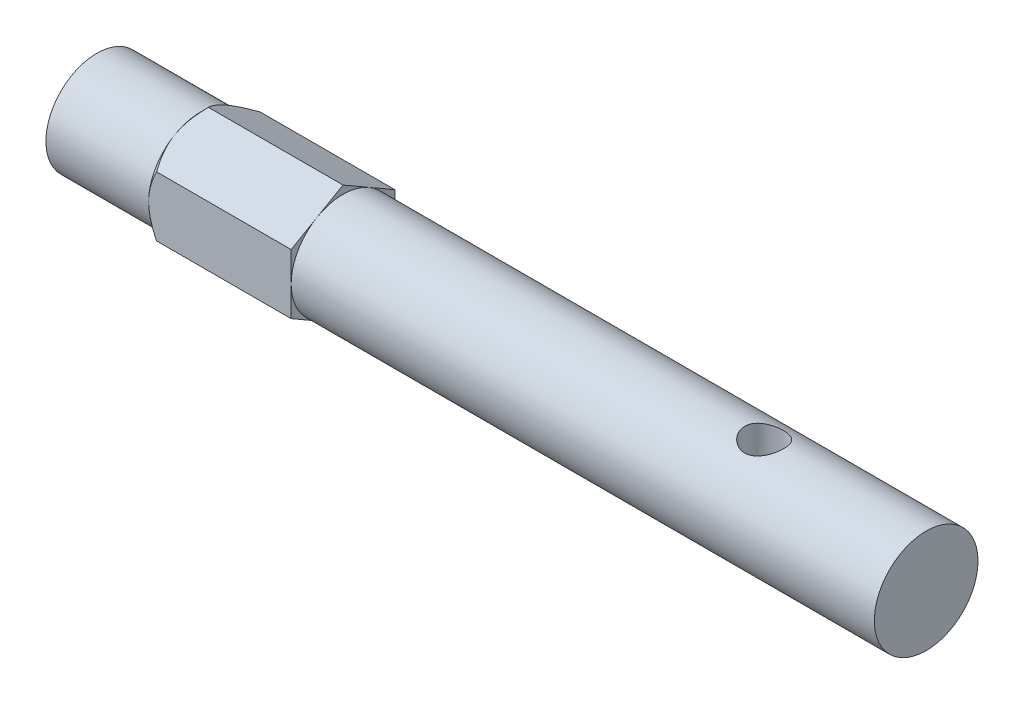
ISO-10303-21;
HEADER;
FILE_DESCRIPTION(('STEP AP214'),'2;1');
FILE_NAME('part.step','',(''),(''),'','','');
FILE_SCHEMA(('AUTOMOTIVE_DESIGN { 1 0 10303 214 1 1 1 1 }'));
ENDSEC;
DATA;
#1=APPLICATION_CONTEXT('core data for automotive mechanical design processes');
#2=APPLICATION_PROTOCOL_DEFINITION('international standard','automotive_design',2000,#1);
#3=PRODUCT_CONTEXT('',#1,'mechanical');
#4=PRODUCT('Part','Part','',(#3));
#5=PRODUCT_RELATED_PRODUCT_CATEGORY('part','',(#4));
#6=PRODUCT_DEFINITION_FORMATION('','',#4);
#7=PRODUCT_DEFINITION_CONTEXT('part definition',#1,'design');
#8=PRODUCT_DEFINITION('design','',#6,#7);
#9=PRODUCT_DEFINITION_SHAPE('','',#8);
#10=(LENGTH_UNIT() NAMED_UNIT(*) SI_UNIT(.MILLI.,.METRE.));
#11=(NAMED_UNIT(*) PLANE_ANGLE_UNIT() SI_UNIT($,.RADIAN.));
#12=(NAMED_UNIT(*) SI_UNIT($,.STERADIAN.) SOLID_ANGLE_UNIT());
#13=UNCERTAINTY_MEASURE_WITH_UNIT(LENGTH_MEASURE(1.E-05),#10,'distance_accuracy_value','');
#14=(GEOMETRIC_REPRESENTATION_CONTEXT(3) GLOBAL_UNCERTAINTY_ASSIGNED_CONTEXT((#13)) GLOBAL_UNIT_ASSIGNED_CONTEXT((#10,
#11,#12)) REPRESENTATION_CONTEXT('',''));
#15=CARTESIAN_POINT('',(0.,0.,0.));
#16=DIRECTION('',(0.,0.,1.));
#17=DIRECTION('',(1.,0.,0.));
#18=AXIS2_PLACEMENT_3D('',#15,#16,#17);
#19=CARTESIAN_POINT('',(1.,0.,0.));
#20=DIRECTION('',(1.,0.,0.));
#21=DIRECTION('',(0.,0.,-1.));
#22=AXIS2_PLACEMENT_3D('',#19,#20,#21);
#23=CONICAL_SURFACE('',#22,5.,0.78539816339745);
#24=CARTESIAN_POINT('',(0.618917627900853,4.61891762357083,0.000199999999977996));
#25=CARTESIAN_POINT('',(0.579211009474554,4.57920690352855,-0.0685809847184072));
#26=CARTESIAN_POINT('',(0.540722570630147,4.5391923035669,-0.137888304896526));
#27=CARTESIAN_POINT('',(0.466553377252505,4.45849274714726,-0.277664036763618));
#28=CARTESIAN_POINT('',(0.43087415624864,4.41780743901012,-0.348133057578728));
#29=CARTESIAN_POINT('',(0.328303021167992,4.29427352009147,-0.562100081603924));
#30=CARTESIAN_POINT('',(0.266315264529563,4.21037499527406,-0.707416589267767));
#31=CARTESIAN_POINT('',(0.160158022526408,4.04121970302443,-1.00040214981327));
#32=CARTESIAN_POINT('',(0.115721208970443,3.95600566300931,-1.14799719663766));
#33=CARTESIAN_POINT('',(0.0472511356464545,3.78369592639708,-1.44644641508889));
#34=CARTESIAN_POINT('',(0.0231667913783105,3.69660550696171,-1.59729144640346));
#35=CARTESIAN_POINT('',(0.0014370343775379,3.54650860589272,-1.85726690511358));
#36=CARTESIAN_POINT('',(-0.00177893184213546,3.48369550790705,-1.96606238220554));
#37=CARTESIAN_POINT('',(0.00364221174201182,3.35817126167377,-2.18347675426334));
#38=CARTESIAN_POINT('',(0.0122834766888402,3.29546015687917,-2.29209557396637));
#39=CARTESIAN_POINT('',(0.0409261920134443,3.1706321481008,-2.50830402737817));
#40=CARTESIAN_POINT('',(0.0609403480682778,3.10851598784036,-2.61589237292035));
#41=CARTESIAN_POINT('',(0.111236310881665,2.98535047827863,-2.82922129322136));
#42=CARTESIAN_POINT('',(0.141517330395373,2.92430104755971,-2.93496200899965));
#43=CARTESIAN_POINT('',(0.203817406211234,2.81592361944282,-3.12267722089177));
#44=CARTESIAN_POINT('',(0.234198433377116,2.76835567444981,-3.20506731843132));
#45=CARTESIAN_POINT('',(0.299856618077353,2.67407371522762,-3.36836846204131));
#46=CARTESIAN_POINT('',(0.335133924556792,2.62735972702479,-3.44927946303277));
#47=CARTESIAN_POINT('',(0.409793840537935,2.53493285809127,-3.60936749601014));
#48=CARTESIAN_POINT('',(0.44916354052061,2.48921734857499,-3.68854908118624));
#49=CARTESIAN_POINT('',(0.531491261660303,2.39863292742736,-3.84544590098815));
#50=CARTESIAN_POINT('',(0.574447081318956,2.35376351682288,-3.92316199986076));
#51=CARTESIAN_POINT('',(0.618917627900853,2.30928560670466,-4.0002));
#52=B_SPLINE_CURVE_WITH_KNOTS('',3,(#24,#25,#26,#27,#28,#29,#30,#31,#32,#33,#34,#35,#36,#37,#38,
#39,#40,#41,#42,#43,#44,#45,#46,#47,#48,#49,#50,#51),.UNSPECIFIED.,.F.,.F.,(4,2,2,2,2,2,2,2,2,2,
2,2,2,4),(0.,0.266361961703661,0.532868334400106,1.06875865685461,1.59613884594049,
2.12219135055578,2.49866160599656,2.87526382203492,3.25228760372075,3.62928248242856,
3.92874944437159,4.22822551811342,4.5267840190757,4.82516056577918),.UNSPECIFIED.);
#53=CARTESIAN_POINT('',(0.,3.46410161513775,-2.));
#54=VERTEX_POINT('',#53);
#55=CARTESIAN_POINT('',(0.618802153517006,2.3094010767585,-4.));
#56=VERTEX_POINT('',#55);
#57=EDGE_CURVE('E198',#54,#56,#52,.T.);
#58=ORIENTED_EDGE('',*,*,#57,.T.);
#59=CARTESIAN_POINT('',(2.90416980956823,-5.62739378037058,-4.));
#60=CARTESIAN_POINT('',(2.7886867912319,-5.4856730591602,-4.));
#61=CARTESIAN_POINT('',(2.67404423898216,-5.34325635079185,-4.));
#62=CARTESIAN_POINT('',(2.44688221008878,-5.05668167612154,-4.));
#63=CARTESIAN_POINT('',(2.33436328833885,-4.91252327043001,-4.));
#64=CARTESIAN_POINT('',(2.11073714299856,-4.62060451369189,-4.));
#65=CARTESIAN_POINT('',(1.99965872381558,-4.47282202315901,-4.));
#66=CARTESIAN_POINT('',(1.78088367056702,-4.17478915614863,-4.));
#67=CARTESIAN_POINT('',(1.67318671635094,-4.02453901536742,-4.));
#68=CARTESIAN_POINT('',(1.45262266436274,-3.70745510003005,-4.));
#69=CARTESIAN_POINT('',(1.34015614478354,-3.5403410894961,-4.));
#70=CARTESIAN_POINT('',(1.1219167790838,-3.2016890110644,-4.));
#71=CARTESIAN_POINT('',(1.01614603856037,-3.03014957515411,-4.));
#72=CARTESIAN_POINT('',(0.814154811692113,-2.68253937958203,-4.00000000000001));
#73=CARTESIAN_POINT('',(0.717892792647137,-2.50649297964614,-4.00000000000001));
#74=CARTESIAN_POINT('',(0.537730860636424,-2.14824323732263,-3.99999999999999));
#75=CARTESIAN_POINT('',(0.453820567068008,-1.9660452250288,-3.99999999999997));
#76=CARTESIAN_POINT('',(0.323778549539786,-1.64622345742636,-3.99999999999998));
#77=CARTESIAN_POINT('',(0.273622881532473,-1.51024779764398,-4.));
#78=CARTESIAN_POINT('',(0.184192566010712,-1.23468247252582,-4.00000000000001));
#79=CARTESIAN_POINT('',(0.144919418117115,-1.09509231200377,-4.));
#80=CARTESIAN_POINT('',(0.0801558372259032,-0.815895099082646,-4.));
#81=CARTESIAN_POINT('',(0.0543844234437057,-0.676354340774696,-4.00000000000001));
#82=CARTESIAN_POINT('',(0.0170833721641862,-0.395369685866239,-4.));
#83=CARTESIAN_POINT('',(0.00555051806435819,-0.253926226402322,-4.));
#84=CARTESIAN_POINT('',(-0.00220491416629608,0.0224344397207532,-4.));
#85=CARTESIAN_POINT('',(0.000849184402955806,0.157331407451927,-4.));
#86=CARTESIAN_POINT('',(0.0203999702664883,0.426139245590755,-4.00000000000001));
#87=CARTESIAN_POINT('',(0.036897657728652,0.560050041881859,-4.));
#88=CARTESIAN_POINT('',(0.0826693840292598,0.828249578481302,-4.));
#89=CARTESIAN_POINT('',(0.112180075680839,0.962497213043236,-4.00000000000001));
#90=CARTESIAN_POINT('',(0.18229509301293,1.22800919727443,-4.));
#91=CARTESIAN_POINT('',(0.222899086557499,1.35927363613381,-4.));
#92=CARTESIAN_POINT('',(0.314947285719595,1.62314822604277,-4.));
#93=CARTESIAN_POINT('',(0.366725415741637,1.7556404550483,-4.));
#94=CARTESIAN_POINT('',(0.478297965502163,2.0172150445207,-4.00000000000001));
#95=CARTESIAN_POINT('',(0.538094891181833,2.14629632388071,-4.));
#96=CARTESIAN_POINT('',(0.664297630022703,2.40167335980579,-4.));
#97=CARTESIAN_POINT('',(0.730723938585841,2.52795890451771,-4.));
#98=CARTESIAN_POINT('',(0.868724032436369,2.77764203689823,-4.));
#99=CARTESIAN_POINT('',(0.940297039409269,2.9010400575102,-4.));
#100=CARTESIAN_POINT('',(1.08394545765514,3.13927957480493,-4.));
#101=CARTESIAN_POINT('',(1.15582080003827,3.25424234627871,-4.));
#102=CARTESIAN_POINT('',(1.3026473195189,3.48219257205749,-4.));
#103=CARTESIAN_POINT('',(1.37759872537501,3.59517987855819,-4.));
#104=CARTESIAN_POINT('',(1.52942464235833,3.81853437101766,-4.));
#105=CARTESIAN_POINT('',(1.60627906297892,3.92891526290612,-4.));
#106=CARTESIAN_POINT('',(1.76206082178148,4.14816043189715,-4.));
#107=CARTESIAN_POINT('',(1.8409875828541,4.25702511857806,-4.));
#108=CARTESIAN_POINT('',(1.9207631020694,4.36525322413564,-4.));
#109=B_SPLINE_CURVE_WITH_KNOTS('',3,(#59,#60,#61,#62,#63,#64,#65,#66,#67,#68,#69,#70,#71,#72,
#73,#74,#75,#76,#77,#78,#79,#80,#81,#82,#83,#84,#85,#86,#87,#88,#89,#90,#91,#92,#93,#94,#95,#96,
#97,#98,#99,#100,#101,#102,#103,#104,#105,#106,#107,#108),.UNSPECIFIED.,.F.,.F.,(4,2,2,2,2,2,2,
2,2,2,2,2,2,2,2,2,2,2,2,2,2,2,2,2,4),(0.,0.548452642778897,1.0970466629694,1.65162724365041,
2.20615515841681,2.8103379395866,3.41470978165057,4.01631281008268,4.61740731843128,
5.05183569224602,5.48632390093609,5.91136971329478,6.33631948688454,6.74042244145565,
7.14455546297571,7.55636228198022,7.96815677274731,8.39458384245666,8.82114448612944,
9.24906733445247,9.67692560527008,10.0836145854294,10.4903338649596,10.8938112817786,
11.2971775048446),.UNSPECIFIED.);
#110=CARTESIAN_POINT('',(0.,0.,-4.));
#111=VERTEX_POINT('',#110);
#112=EDGE_CURVE('E11',#56,#111,#109,.F.);
#113=ORIENTED_EDGE('',*,*,#112,.T.);
#114=CARTESIAN_POINT('',(0.,0.,0.));
#115=DIRECTION('',(-1.,0.,0.));
#116=DIRECTION('',(0.,0.,1.));
#117=AXIS2_PLACEMENT_3D('',#114,#115,#116);
#118=CIRCLE('',#117,4.);
#119=EDGE_CURVE('E157',#54,#111,#118,.T.);
#120=ORIENTED_EDGE('',*,*,#119,.F.);
#121=EDGE_LOOP('',(#58,#113,#120));
#122=FACE_BOUND('',#121,.T.);
#123=ADVANCED_FACE('F32',(#122),#23,.T.);
#124=CARTESIAN_POINT('',(0.,-3.46410161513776,-2.));
#125=VERTEX_POINT('',#124);
#126=EDGE_CURVE('E561',#111,#125,#118,.T.);
#127=ORIENTED_EDGE('',*,*,#126,.F.);
#128=CARTESIAN_POINT('',(0.618802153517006,-2.3094010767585,-4.));
#129=VERTEX_POINT('',#128);
#130=EDGE_CURVE('E44',#111,#129,#109,.F.);
#131=ORIENTED_EDGE('',*,*,#130,.T.);
#132=CARTESIAN_POINT('',(0.618917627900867,-2.30928560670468,-4.0002));
#133=CARTESIAN_POINT('',(0.579211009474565,-2.34899632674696,-3.93141901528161));
#134=CARTESIAN_POINT('',(0.540722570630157,-2.38901092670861,-3.86211169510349));
#135=CARTESIAN_POINT('',(0.466553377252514,-2.46971048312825,-3.7223359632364));
#136=CARTESIAN_POINT('',(0.43087415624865,-2.51039579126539,-3.65186694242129));
#137=CARTESIAN_POINT('',(0.328303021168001,-2.63392971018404,-3.43789991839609));
#138=CARTESIAN_POINT('',(0.266315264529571,-2.71782823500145,-3.29258341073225));
#139=CARTESIAN_POINT('',(0.160158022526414,-2.88698352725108,-2.99959785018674));
#140=CARTESIAN_POINT('',(0.115721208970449,-2.9721975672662,-2.85200280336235));
#141=CARTESIAN_POINT('',(0.0472511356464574,-3.14450730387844,-2.55355358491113));
#142=CARTESIAN_POINT('',(0.02316679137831,-3.23159772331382,-2.40270855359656));
#143=CARTESIAN_POINT('',(0.00143703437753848,-3.3816946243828,-2.14273309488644));
#144=CARTESIAN_POINT('',(-0.00177893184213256,-3.44450772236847,-2.03393761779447));
#145=CARTESIAN_POINT('',(0.00364221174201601,-3.57003196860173,-1.81652324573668));
#146=CARTESIAN_POINT('',(0.0122834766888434,-3.63274307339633,-1.70790442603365));
#147=CARTESIAN_POINT('',(0.0409261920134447,-3.75757108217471,-1.49169597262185));
#148=CARTESIAN_POINT('',(0.0609403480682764,-3.81968724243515,-1.38410762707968));
#149=CARTESIAN_POINT('',(0.111236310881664,-3.94285275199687,-1.17077870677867));
#150=CARTESIAN_POINT('',(0.141517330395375,-4.00390218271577,-1.06503799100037));
#151=CARTESIAN_POINT('',(0.203817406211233,-4.11227961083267,-0.877322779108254));
#152=CARTESIAN_POINT('',(0.234198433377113,-4.15984755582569,-0.794932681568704));
#153=CARTESIAN_POINT('',(0.299856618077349,-4.25412951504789,-0.631631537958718));
#154=CARTESIAN_POINT('',(0.335133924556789,-4.30084350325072,-0.55072053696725));
#155=CARTESIAN_POINT('',(0.409793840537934,-4.39327037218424,-0.390632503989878));
#156=CARTESIAN_POINT('',(0.449163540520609,-4.43898588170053,-0.311450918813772));
#157=CARTESIAN_POINT('',(0.531491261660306,-4.52957030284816,-0.154554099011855));
#158=CARTESIAN_POINT('',(0.574447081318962,-4.57443971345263,-0.0768380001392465));
#159=CARTESIAN_POINT('',(0.618917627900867,-4.61891762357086,0.000199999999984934));
#160=B_SPLINE_CURVE_WITH_KNOTS('',3,(#132,#133,#134,#135,#136,#137,#138,#139,#140,#141,#142,
#143,#144,#145,#146,#147,#148,#149,#150,#151,#152,#153,#154,#155,#156,#157,#158,#159),
.UNSPECIFIED.,.F.,.F.,(4,2,2,2,2,2,2,2,2,2,2,2,2,4),(0.,0.266361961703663,0.532868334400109,
1.06875865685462,1.5961388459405,2.12219135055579,2.49866160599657,2.87526382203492,
3.25228760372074,3.62928248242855,3.92874944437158,4.22822551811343,4.52678401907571,
4.8251605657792),.UNSPECIFIED.);
#161=EDGE_CURVE('E355',#129,#125,#160,.T.);
#162=ORIENTED_EDGE('',*,*,#161,.T.);
#163=EDGE_LOOP('',(#127,#131,#162));
#164=FACE_BOUND('',#163,.T.);
#165=ADVANCED_FACE('F239',(#164),#23,.T.);
#166=CARTESIAN_POINT('',(0.,-3.46410161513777,2.));
#167=VERTEX_POINT('',#166);
#168=EDGE_CURVE('E151',#125,#167,#118,.T.);
#169=ORIENTED_EDGE('',*,*,#168,.F.);
#170=CARTESIAN_POINT('',(0.618802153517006,-4.618802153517,0.));
#171=VERTEX_POINT('',#170);
#172=EDGE_CURVE('E196',#125,#171,#160,.T.);
#173=ORIENTED_EDGE('',*,*,#172,.T.);
#174=CARTESIAN_POINT('',(0.618917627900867,-4.61891762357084,-0.000199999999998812));
#175=CARTESIAN_POINT('',(0.579211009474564,-4.57920690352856,0.0685809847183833));
#176=CARTESIAN_POINT('',(0.540722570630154,-4.53919230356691,0.137888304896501));
#177=CARTESIAN_POINT('',(0.46655337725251,-4.45849274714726,0.277664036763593));
#178=CARTESIAN_POINT('',(0.430874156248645,-4.41780743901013,0.348133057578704));
#179=CARTESIAN_POINT('',(0.328303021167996,-4.29427352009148,0.562100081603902));
#180=CARTESIAN_POINT('',(0.266315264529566,-4.21037499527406,0.707416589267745));
#181=CARTESIAN_POINT('',(0.160158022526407,-4.04121970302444,1.00040214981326));
#182=CARTESIAN_POINT('',(0.115721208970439,-3.95600566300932,1.14799719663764));
#183=CARTESIAN_POINT('',(0.0472511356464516,-3.78369592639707,1.44644641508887));
#184=CARTESIAN_POINT('',(0.0231667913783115,-3.69660550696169,1.59729144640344));
#185=CARTESIAN_POINT('',(0.00143703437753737,-3.5465086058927,1.85726690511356));
#186=CARTESIAN_POINT('',(-0.0017789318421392,-3.48369550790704,1.96606238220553));
#187=CARTESIAN_POINT('',(0.00364221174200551,-3.35817126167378,2.18347675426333));
#188=CARTESIAN_POINT('',(0.0122834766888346,-3.29546015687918,2.29209557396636));
#189=CARTESIAN_POINT('',(0.0409261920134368,-3.1706321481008,2.50830402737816));
#190=CARTESIAN_POINT('',(0.0609403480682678,-3.10851598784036,2.61589237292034));
#191=CARTESIAN_POINT('',(0.111236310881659,-2.98535047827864,2.82922129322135));
#192=CARTESIAN_POINT('',(0.141517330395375,-2.92430104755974,2.93496200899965));
#193=CARTESIAN_POINT('',(0.203817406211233,-2.81592361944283,3.12267722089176));
#194=CARTESIAN_POINT('',(0.23419843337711,-2.76835567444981,3.20506731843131));
#195=CARTESIAN_POINT('',(0.299856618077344,-2.67407371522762,3.36836846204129));
#196=CARTESIAN_POINT('',(0.335133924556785,-2.62735972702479,3.44927946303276));
#197=CARTESIAN_POINT('',(0.409793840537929,-2.53493285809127,3.60936749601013));
#198=CARTESIAN_POINT('',(0.449163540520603,-2.48921734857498,3.68854908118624));
#199=CARTESIAN_POINT('',(0.5314912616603,-2.39863292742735,3.84544590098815));
#200=CARTESIAN_POINT('',(0.574447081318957,-2.35376351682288,3.92316199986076));
#201=CARTESIAN_POINT('',(0.618917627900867,-2.30928560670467,4.0002));
#202=B_SPLINE_CURVE_WITH_KNOTS('',3,(#174,#175,#176,#177,#178,#179,#180,#181,#182,#183,#184,
#185,#186,#187,#188,#189,#190,#191,#192,#193,#194,#195,#196,#197,#198,#199,#200,#201),
.UNSPECIFIED.,.F.,.F.,(4,2,2,2,2,2,2,2,2,2,2,2,2,4),(0.,0.266361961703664,0.532868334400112,
1.06875865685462,1.59613884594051,2.1221913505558,2.49866160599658,2.87526382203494,
3.25228760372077,3.62928248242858,3.92874944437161,4.22822551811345,4.52678401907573,
4.82516056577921),.UNSPECIFIED.);
#203=EDGE_CURVE('E189',#171,#167,#202,.T.);
#204=ORIENTED_EDGE('',*,*,#203,.T.);
#205=EDGE_LOOP('',(#169,#173,#204));
#206=FACE_BOUND('',#205,.T.);
#207=ADVANCED_FACE('F244',(#206),#23,.T.);
#208=CARTESIAN_POINT('',(0.618917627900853,2.30928560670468,4.00020000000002));
#209=CARTESIAN_POINT('',(0.579211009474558,2.34899632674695,3.93141901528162));
#210=CARTESIAN_POINT('',(0.540722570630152,2.38901092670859,3.8621116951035));
#211=CARTESIAN_POINT('',(0.46655337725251,2.46971048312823,3.72233596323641));
#212=CARTESIAN_POINT('',(0.430874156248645,2.51039579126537,3.6518669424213));
#213=CARTESIAN_POINT('',(0.328303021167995,2.63392971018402,3.4378999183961));
#214=CARTESIAN_POINT('',(0.266315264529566,2.71782823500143,3.29258341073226));
#215=CARTESIAN_POINT('',(0.160158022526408,2.88698352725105,2.99959785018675));
#216=CARTESIAN_POINT('',(0.11572120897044,2.97219756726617,2.85200280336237));
#217=CARTESIAN_POINT('',(0.0472511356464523,3.14450730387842,2.55355358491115));
#218=CARTESIAN_POINT('',(0.0231667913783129,3.2315977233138,2.40270855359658));
#219=CARTESIAN_POINT('',(0.00143703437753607,3.38169462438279,2.14273309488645));
#220=CARTESIAN_POINT('',(-0.00177893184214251,3.44450772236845,2.03393761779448));
#221=CARTESIAN_POINT('',(0.00364221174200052,3.57003196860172,1.81652324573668));
#222=CARTESIAN_POINT('',(0.0122834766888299,3.63274307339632,1.70790442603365));
#223=CARTESIAN_POINT('',(0.040926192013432,3.7575710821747,1.49169597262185));
#224=CARTESIAN_POINT('',(0.0609403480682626,3.81968724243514,1.38410762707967));
#225=CARTESIAN_POINT('',(0.111236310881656,3.94285275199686,1.17077870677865));
#226=CARTESIAN_POINT('',(0.141517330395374,4.00390218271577,1.06503799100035));
#227=CARTESIAN_POINT('',(0.203817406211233,4.11227961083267,0.877322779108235));
#228=CARTESIAN_POINT('',(0.234198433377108,4.15984755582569,0.794932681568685));
#229=CARTESIAN_POINT('',(0.29985661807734,4.25412951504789,0.631631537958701));
#230=CARTESIAN_POINT('',(0.335133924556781,4.30084350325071,0.550720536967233));
#231=CARTESIAN_POINT('',(0.409793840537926,4.39327037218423,0.390632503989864));
#232=CARTESIAN_POINT('',(0.449163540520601,4.43898588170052,0.31145091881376));
#233=CARTESIAN_POINT('',(0.531491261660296,4.52957030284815,0.154554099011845));
#234=CARTESIAN_POINT('',(0.57444708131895,4.57443971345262,0.0768380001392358));
#235=CARTESIAN_POINT('',(0.618917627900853,4.61891762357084,-0.000199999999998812));
#236=B_SPLINE_CURVE_WITH_KNOTS('',3,(#208,#209,#210,#211,#212,#213,#214,#215,#216,#217,#218,
#219,#220,#221,#222,#223,#224,#225,#226,#227,#228,#229,#230,#231,#232,#233,#234,#235),
.UNSPECIFIED.,.F.,.F.,(4,2,2,2,2,2,2,2,2,2,2,2,2,4),(0.,0.266361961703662,0.532868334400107,
1.06875865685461,1.59613884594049,2.12219135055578,2.49866160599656,2.87526382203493,
3.25228760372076,3.62928248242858,3.92874944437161,4.22822551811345,4.52678401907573,
4.82516056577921),.UNSPECIFIED.);
#237=CARTESIAN_POINT('',(0.,3.46410161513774,2.));
#238=VERTEX_POINT('',#237);
#239=CARTESIAN_POINT('',(0.618802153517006,4.618802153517,0.));
#240=VERTEX_POINT('',#239);
#241=EDGE_CURVE('E197',#238,#240,#236,.T.);
#242=ORIENTED_EDGE('',*,*,#241,.T.);
#243=EDGE_CURVE('E190',#240,#54,#52,.T.);
#244=ORIENTED_EDGE('',*,*,#243,.T.);
#245=EDGE_CURVE('E156',#238,#54,#118,.T.);
#246=ORIENTED_EDGE('',*,*,#245,.F.);
#247=EDGE_LOOP('',(#242,#244,#246));
#248=FACE_BOUND('',#247,.T.);
#249=ADVANCED_FACE('F254',(#248),#23,.T.);
#250=CARTESIAN_POINT('',(0.,0.,4.));
#251=VERTEX_POINT('',#250);
#252=EDGE_CURVE('E140',#167,#251,#118,.T.);
#253=ORIENTED_EDGE('',*,*,#252,.F.);
#254=CARTESIAN_POINT('',(0.618802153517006,-2.3094010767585,4.00000000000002));
#255=VERTEX_POINT('',#254);
#256=EDGE_CURVE('E142',#167,#255,#202,.T.);
#257=ORIENTED_EDGE('',*,*,#256,.T.);
#258=CARTESIAN_POINT('',(2.90416980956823,-5.62739378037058,4.));
#259=CARTESIAN_POINT('',(2.7886867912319,-5.4856730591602,4.00000000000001));
#260=CARTESIAN_POINT('',(2.67404423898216,-5.34325635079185,4.00000000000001));
#261=CARTESIAN_POINT('',(2.44688221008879,-5.05668167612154,4.00000000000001));
#262=CARTESIAN_POINT('',(2.33436328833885,-4.91252327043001,4.00000000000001));
#263=CARTESIAN_POINT('',(2.11073714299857,-4.62060451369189,4.00000000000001));
#264=CARTESIAN_POINT('',(1.99965872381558,-4.47282202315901,4.00000000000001));
#265=CARTESIAN_POINT('',(1.78088367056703,-4.17478915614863,4.00000000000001));
#266=CARTESIAN_POINT('',(1.67318671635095,-4.02453901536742,4.00000000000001));
#267=CARTESIAN_POINT('',(1.45262266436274,-3.70745510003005,4.00000000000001));
#268=CARTESIAN_POINT('',(1.34015614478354,-3.5403410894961,4.00000000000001));
#269=CARTESIAN_POINT('',(1.12191677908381,-3.2016890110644,4.00000000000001));
#270=CARTESIAN_POINT('',(1.01614603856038,-3.03014957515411,4.00000000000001));
#271=CARTESIAN_POINT('',(0.814154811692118,-2.68253937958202,4.00000000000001));
#272=CARTESIAN_POINT('',(0.717892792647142,-2.50649297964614,4.00000000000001));
#273=CARTESIAN_POINT('',(0.537730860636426,-2.14824323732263,4.00000000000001));
#274=CARTESIAN_POINT('',(0.453820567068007,-1.9660452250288,4.00000000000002));
#275=CARTESIAN_POINT('',(0.323778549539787,-1.64622345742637,4.00000000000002));
#276=CARTESIAN_POINT('',(0.273622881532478,-1.51024779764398,4.00000000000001));
#277=CARTESIAN_POINT('',(0.18419256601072,-1.23468247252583,4.00000000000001));
#278=CARTESIAN_POINT('',(0.144919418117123,-1.09509231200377,4.00000000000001));
#279=CARTESIAN_POINT('',(0.0801558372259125,-0.815895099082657,4.00000000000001));
#280=CARTESIAN_POINT('',(0.0543844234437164,-0.676354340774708,4.00000000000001));
#281=CARTESIAN_POINT('',(0.0170833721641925,-0.395369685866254,4.00000000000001));
#282=CARTESIAN_POINT('',(0.00555051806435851,-0.25392622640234,4.));
#283=CARTESIAN_POINT('',(-0.00220491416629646,0.0224344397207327,4.));
#284=CARTESIAN_POINT('',(0.000849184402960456,0.157331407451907,4.00000000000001));
#285=CARTESIAN_POINT('',(0.0203999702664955,0.426139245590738,4.00000000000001));
#286=CARTESIAN_POINT('',(0.0368976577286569,0.560050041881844,4.00000000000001));
#287=CARTESIAN_POINT('',(0.0826693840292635,0.828249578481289,4.00000000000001));
#288=CARTESIAN_POINT('',(0.112180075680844,0.962497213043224,4.00000000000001));
#289=CARTESIAN_POINT('',(0.182295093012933,1.22800919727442,4.00000000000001));
#290=CARTESIAN_POINT('',(0.222899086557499,1.3592736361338,4.));
#291=CARTESIAN_POINT('',(0.314947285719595,1.62314822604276,4.));
#292=CARTESIAN_POINT('',(0.366725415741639,1.75564045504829,4.00000000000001));
#293=CARTESIAN_POINT('',(0.478297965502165,2.01721504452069,4.00000000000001));
#294=CARTESIAN_POINT('',(0.538094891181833,2.1462963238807,4.00000000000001));
#295=CARTESIAN_POINT('',(0.664297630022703,2.40167335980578,4.00000000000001));
#296=CARTESIAN_POINT('',(0.730723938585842,2.5279589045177,4.00000000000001));
#297=CARTESIAN_POINT('',(0.868724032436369,2.77764203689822,4.00000000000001));
#298=CARTESIAN_POINT('',(0.940297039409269,2.90104005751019,4.00000000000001));
#299=CARTESIAN_POINT('',(1.08394545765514,3.13927957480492,4.00000000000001));
#300=CARTESIAN_POINT('',(1.15582080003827,3.2542423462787,4.00000000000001));
#301=CARTESIAN_POINT('',(1.30264731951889,3.48219257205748,4.00000000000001));
#302=CARTESIAN_POINT('',(1.377598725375,3.59517987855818,4.00000000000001));
#303=CARTESIAN_POINT('',(1.52942464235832,3.81853437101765,4.00000000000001));
#304=CARTESIAN_POINT('',(1.60627906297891,3.92891526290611,4.00000000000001));
#305=CARTESIAN_POINT('',(1.76206082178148,4.14816043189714,4.00000000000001));
#306=CARTESIAN_POINT('',(1.8409875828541,4.25702511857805,4.00000000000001));
#307=CARTESIAN_POINT('',(1.9207631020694,4.36525322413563,4.));
#308=B_SPLINE_CURVE_WITH_KNOTS('',3,(#258,#259,#260,#261,#262,#263,#264,#265,#266,#267,#268,
#269,#270,#271,#272,#273,#274,#275,#276,#277,#278,#279,#280,#281,#282,#283,#284,#285,#286,#287,
#288,#289,#290,#291,#292,#293,#294,#295,#296,#297,#298,#299,#300,#301,#302,#303,#304,#305,#306,
#307),.UNSPECIFIED.,.F.,.F.,(4,2,2,2,2,2,2,2,2,2,2,2,2,2,2,2,2,2,2,2,2,2,2,2,4),(0.,
0.548452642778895,1.0970466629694,1.6516272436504,2.20615515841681,2.8103379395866,
3.41470978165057,4.01631281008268,4.61740731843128,5.05183569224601,5.48632390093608,
5.91136971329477,6.33631948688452,6.74042244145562,7.14455546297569,7.55636228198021,
7.9681567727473,8.39458384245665,8.82114448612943,9.24906733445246,9.67692560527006,
10.0836145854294,10.4903338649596,10.8938112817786,11.2971775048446),.UNSPECIFIED.);
#309=EDGE_CURVE('E129',#255,#251,#308,.T.);
#310=ORIENTED_EDGE('',*,*,#309,.T.);
#311=EDGE_LOOP('',(#253,#257,#310));
#312=FACE_BOUND('',#311,.T.);
#313=ADVANCED_FACE('F139',(#312),#23,.T.);
#314=CARTESIAN_POINT('',(0.618802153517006,2.30940107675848,4.));
#315=VERTEX_POINT('',#314);
#316=EDGE_CURVE('E126',#251,#315,#308,.T.);
#317=ORIENTED_EDGE('',*,*,#316,.T.);
#318=EDGE_CURVE('E143',#315,#238,#236,.T.);
#319=ORIENTED_EDGE('',*,*,#318,.T.);
#320=EDGE_CURVE('E133',#251,#238,#118,.T.);
#321=ORIENTED_EDGE('',*,*,#320,.F.);
#322=EDGE_LOOP('',(#317,#319,#321));
#323=FACE_BOUND('',#322,.T.);
#324=ADVANCED_FACE('F154',(#323),#23,.T.);
#325=CARTESIAN_POINT('',(0.,3.92499999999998,0.));
#326=DIRECTION('',(-1.,0.,0.));
#327=DIRECTION('',(0.,0.,1.));
#328=AXIS2_PLACEMENT_3D('',#325,#326,#327);
#329=PLANE('',#328);
#330=ORIENTED_EDGE('',*,*,#320,.T.);
#331=ORIENTED_EDGE('',*,*,#245,.T.);
#332=ORIENTED_EDGE('',*,*,#119,.T.);
#333=ORIENTED_EDGE('',*,*,#126,.T.);
#334=ORIENTED_EDGE('',*,*,#168,.T.);
#335=ORIENTED_EDGE('',*,*,#252,.T.);
#336=EDGE_LOOP('',(#330,#331,#332,#333,#334,#335));
#337=FACE_BOUND('',#336,.T.);
#338=CARTESIAN_POINT('',(0.,0.,0.));
#339=DIRECTION('',(1.,0.,0.));
#340=DIRECTION('',(0.,0.,-1.));
#341=AXIS2_PLACEMENT_3D('',#338,#339,#340);
#342=CIRCLE('',#341,3.925);
#343=CARTESIAN_POINT('',(0.,0.,-3.925));
#344=VERTEX_POINT('',#343);
#345=EDGE_CURVE('E323',#344,#344,#342,.T.);
#346=ORIENTED_EDGE('',*,*,#345,.T.);
#347=EDGE_LOOP('',(#346));
#348=FACE_BOUND('',#347,.T.);
#349=ADVANCED_FACE('F146',(#337,#348),#329,.T.);
#350=CARTESIAN_POINT('',(0.,0.,0.));
#351=DIRECTION('',(1.,0.,0.));
#352=DIRECTION('',(0.,0.,-1.));
#353=AXIS2_PLACEMENT_3D('',#350,#351,#352);
#354=CYLINDRICAL_SURFACE('',#353,3.925);
#355=CARTESIAN_POINT('',(-8.00000000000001,0.,0.));
#356=DIRECTION('',(1.,0.,0.));
#357=DIRECTION('',(0.,0.,-1.));
#358=AXIS2_PLACEMENT_3D('',#355,#356,#357);
#359=CIRCLE('',#358,3.925);
#360=CARTESIAN_POINT('',(-8.00000000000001,0.,-3.925));
#361=VERTEX_POINT('',#360);
#362=EDGE_CURVE('E320',#361,#361,#359,.T.);
#363=ORIENTED_EDGE('',*,*,#362,.T.);
#364=EDGE_LOOP('',(#363));
#365=FACE_BOUND('',#364,.T.);
#366=ORIENTED_EDGE('',*,*,#345,.F.);
#367=EDGE_LOOP('',(#366));
#368=FACE_BOUND('',#367,.T.);
#369=ADVANCED_FACE('F252',(#365,#368),#354,.T.);
#370=CARTESIAN_POINT('',(-8.00000000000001,3.86639078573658,0.));
#371=DIRECTION('',(-1.,0.,0.));
#372=DIRECTION('',(0.,0.,1.));
#373=AXIS2_PLACEMENT_3D('',#370,#371,#372);
#374=PLANE('',#373);
#375=CARTESIAN_POINT('',(-8.00000000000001,0.,0.));
#376=DIRECTION('',(1.,0.,0.));
#377=DIRECTION('',(0.,0.,-1.));
#378=AXIS2_PLACEMENT_3D('',#375,#376,#377);
#379=CIRCLE('',#378,3.86639078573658);
#380=CARTESIAN_POINT('',(-8.00000000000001,0.,-3.86639078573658));
#381=VERTEX_POINT('',#380);
#382=EDGE_CURVE('E317',#381,#381,#379,.T.);
#383=ORIENTED_EDGE('',*,*,#382,.T.);
#384=EDGE_LOOP('',(#383));
#385=FACE_BOUND('',#384,.T.);
#386=ORIENTED_EDGE('',*,*,#362,.F.);
#387=EDGE_LOOP('',(#386));
#388=FACE_BOUND('',#387,.T.);
#389=ADVANCED_FACE('F449',(#385,#388),#374,.T.);
#390=CARTESIAN_POINT('',(-8.00000000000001,0.,0.));
#391=DIRECTION('',(-1.,0.,0.));
#392=DIRECTION('',(0.,0.,1.));
#393=AXIS2_PLACEMENT_3D('',#390,#391,#392);
#394=CONICAL_SURFACE('',#393,3.86639078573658,0.523598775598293);
#395=CARTESIAN_POINT('',(-3.90129092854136,0.,0.));
#396=DIRECTION('',(1.,0.,0.));
#397=DIRECTION('',(0.,0.,-1.));
#398=AXIS2_PLACEMENT_3D('',#395,#396,#397);
#399=CIRCLE('',#398,1.5);
#400=CARTESIAN_POINT('',(-3.90129092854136,0.,-1.5));
#401=VERTEX_POINT('',#400);
#402=EDGE_CURVE('E314',#401,#401,#399,.T.);
#403=ORIENTED_EDGE('',*,*,#402,.T.);
#404=EDGE_LOOP('',(#403));
#405=FACE_BOUND('',#404,.T.);
#406=ORIENTED_EDGE('',*,*,#382,.F.);
#407=EDGE_LOOP('',(#406));
#408=FACE_BOUND('',#407,.T.);
#409=ADVANCED_FACE('F440',(#405,#408),#394,.F.);
#410=CARTESIAN_POINT('',(0.,0.,0.));
#411=DIRECTION('',(1.,0.,0.));
#412=DIRECTION('',(0.,0.,-1.));
#413=AXIS2_PLACEMENT_3D('',#410,#411,#412);
#414=CYLINDRICAL_SURFACE('',#413,1.5);
#415=CARTESIAN_POINT('',(-0.901290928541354,0.,0.));
#416=DIRECTION('',(1.,0.,0.));
#417=DIRECTION('',(0.,0.,-1.));
#418=AXIS2_PLACEMENT_3D('',#415,#416,#417);
#419=CIRCLE('',#418,1.5);
#420=CARTESIAN_POINT('',(-0.901290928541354,0.,-1.5));
#421=VERTEX_POINT('',#420);
#422=EDGE_CURVE('E311',#421,#421,#419,.T.);
#423=ORIENTED_EDGE('',*,*,#422,.T.);
#424=EDGE_LOOP('',(#423));
#425=FACE_BOUND('',#424,.T.);
#426=ORIENTED_EDGE('',*,*,#402,.F.);
#427=EDGE_LOOP('',(#426));
#428=FACE_BOUND('',#427,.T.);
#429=ADVANCED_FACE('F431',(#425,#428),#414,.F.);
#430=CARTESIAN_POINT('',(-0.901290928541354,0.,0.));
#431=DIRECTION('',(-1.,0.,0.));
#432=DIRECTION('',(0.,0.,1.));
#433=AXIS2_PLACEMENT_3D('',#430,#431,#432);
#434=CONICAL_SURFACE('',#433,1.5,1.02974425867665);
#435=CARTESIAN_POINT('',(0.,0.,0.));
#436=VERTEX_POINT('',#435);
#437=VERTEX_LOOP('',#436);
#438=FACE_BOUND('',#437,.T.);
#439=ORIENTED_EDGE('',*,*,#422,.F.);
#440=EDGE_LOOP('',(#439));
#441=FACE_BOUND('',#440,.T.);
#442=ADVANCED_FACE('F183',(#438,#441),#434,.F.);
#443=CARTESIAN_POINT('',(56.,-4.618802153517,0.));
#444=DIRECTION('',(0.,-0.866025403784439,0.5));
#445=DIRECTION('',(0.,-0.5,-0.866025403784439));
#446=AXIS2_PLACEMENT_3D('',#443,#444,#445);
#447=PLANE('',#446);
#448=DIRECTION('',(-1.,0.,0.));
#449=VECTOR('',#448,1.);
#450=CARTESIAN_POINT('',(56.,-2.30940107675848,4.00000000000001));
#451=LINE('',#450,#449);
#452=CARTESIAN_POINT('',(11.,-2.3094010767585,4.00000000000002));
#453=VERTEX_POINT('',#452);
#454=EDGE_CURVE('E52',#453,#255,#451,.T.);
#455=ORIENTED_EDGE('',*,*,#454,.T.);
#456=ORIENTED_EDGE('',*,*,#256,.F.);
#457=ORIENTED_EDGE('',*,*,#203,.F.);
#458=DIRECTION('',(-1.,0.,0.));
#459=VECTOR('',#458,1.);
#460=CARTESIAN_POINT('',(56.,-4.618802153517,0.));
#461=LINE('',#460,#459);
#462=CARTESIAN_POINT('',(11.,-4.618802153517,0.));
#463=VERTEX_POINT('',#462);
#464=EDGE_CURVE('E271',#463,#171,#461,.T.);
#465=ORIENTED_EDGE('',*,*,#464,.F.);
#466=DIRECTION('',(0.,-0.5,-0.866025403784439));
#467=VECTOR('',#466,1.);
#468=CARTESIAN_POINT('',(11.,-2.46410161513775,3.73205080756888));
#469=LINE('',#468,#467);
#470=CARTESIAN_POINT('',(11.,-3.46410161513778,2.00000000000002));
#471=VERTEX_POINT('',#470);
#472=EDGE_CURVE('E308',#471,#463,#469,.T.);
#473=ORIENTED_EDGE('',*,*,#472,.F.);
#474=EDGE_CURVE('E310',#453,#471,#469,.T.);
#475=ORIENTED_EDGE('',*,*,#474,.F.);
#476=EDGE_LOOP('',(#455,#456,#457,#465,#473,#475));
#477=FACE_BOUND('',#476,.T.);
#478=ADVANCED_FACE('F179',(#477),#447,.T.);
#479=CARTESIAN_POINT('',(56.,-2.3094010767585,-4.00000000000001));
#480=DIRECTION('',(0.,-0.866025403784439,-0.5));
#481=DIRECTION('',(0.,0.5,-0.866025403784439));
#482=AXIS2_PLACEMENT_3D('',#479,#480,#481);
#483=PLANE('',#482);
#484=ORIENTED_EDGE('',*,*,#464,.T.);
#485=ORIENTED_EDGE('',*,*,#172,.F.);
#486=ORIENTED_EDGE('',*,*,#161,.F.);
#487=DIRECTION('',(-1.,0.,0.));
#488=VECTOR('',#487,1.);
#489=CARTESIAN_POINT('',(56.,-2.3094010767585,-4.00000000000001));
#490=LINE('',#489,#488);
#491=CARTESIAN_POINT('',(11.,-2.3094010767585,-4.));
#492=VERTEX_POINT('',#491);
#493=EDGE_CURVE('E278',#492,#129,#490,.T.);
#494=ORIENTED_EDGE('',*,*,#493,.F.);
#495=DIRECTION('',(0.,0.5,-0.866025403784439));
#496=VECTOR('',#495,1.);
#497=CARTESIAN_POINT('',(11.,-2.46410161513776,-3.73205080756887));
#498=LINE('',#497,#496);
#499=CARTESIAN_POINT('',(11.,-3.46410161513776,-2.));
#500=VERTEX_POINT('',#499);
#501=EDGE_CURVE('E305',#500,#492,#498,.T.);
#502=ORIENTED_EDGE('',*,*,#501,.F.);
#503=EDGE_CURVE('E276',#463,#500,#498,.T.);
#504=ORIENTED_EDGE('',*,*,#503,.F.);
#505=EDGE_LOOP('',(#484,#485,#486,#494,#502,#504));
#506=FACE_BOUND('',#505,.T.);
#507=ADVANCED_FACE('F182',(#506),#483,.T.);
#508=CARTESIAN_POINT('',(56.,2.3094010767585,-4.));
#509=DIRECTION('',(0.,0.,-1.));
#510=DIRECTION('',(-1.,0.,0.));
#511=AXIS2_PLACEMENT_3D('',#508,#509,#510);
#512=PLANE('',#511);
#513=ORIENTED_EDGE('',*,*,#493,.T.);
#514=ORIENTED_EDGE('',*,*,#130,.F.);
#515=ORIENTED_EDGE('',*,*,#112,.F.);
#516=DIRECTION('',(-1.,0.,0.));
#517=VECTOR('',#516,1.);
#518=CARTESIAN_POINT('',(56.,2.3094010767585,-4.));
#519=LINE('',#518,#517);
#520=CARTESIAN_POINT('',(11.,2.3094010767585,-3.99999999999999));
#521=VERTEX_POINT('',#520);
#522=EDGE_CURVE('E284',#521,#56,#519,.T.);
#523=ORIENTED_EDGE('',*,*,#522,.F.);
#524=DIRECTION('',(0.,1.,0.));
#525=VECTOR('',#524,1.);
#526=CARTESIAN_POINT('',(11.,4.,-4.));
#527=LINE('',#526,#525);
#528=CARTESIAN_POINT('',(11.,0.,-4.));
#529=VERTEX_POINT('',#528);
#530=EDGE_CURVE('E301',#529,#521,#527,.T.);
#531=ORIENTED_EDGE('',*,*,#530,.F.);
#532=EDGE_CURVE('E304',#492,#529,#527,.T.);
#533=ORIENTED_EDGE('',*,*,#532,.F.);
#534=EDGE_LOOP('',(#513,#514,#515,#523,#531,#533));
#535=FACE_BOUND('',#534,.T.);
#536=ADVANCED_FACE('F207',(#535),#512,.T.);
#537=CARTESIAN_POINT('',(56.,4.61880215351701,0.));
#538=DIRECTION('',(0.,0.866025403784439,-0.5));
#539=DIRECTION('',(0.,0.5,0.866025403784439));
#540=AXIS2_PLACEMENT_3D('',#537,#538,#539);
#541=PLANE('',#540);
#542=ORIENTED_EDGE('',*,*,#522,.T.);
#543=ORIENTED_EDGE('',*,*,#57,.F.);
#544=ORIENTED_EDGE('',*,*,#243,.F.);
#545=DIRECTION('',(-1.,0.,0.));
#546=VECTOR('',#545,1.);
#547=CARTESIAN_POINT('',(56.,4.61880215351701,0.));
#548=LINE('',#547,#546);
#549=CARTESIAN_POINT('',(11.,4.618802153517,0.));
#550=VERTEX_POINT('',#549);
#551=EDGE_CURVE('E289',#550,#240,#548,.T.);
#552=ORIENTED_EDGE('',*,*,#551,.F.);
#553=DIRECTION('',(0.,0.5,0.866025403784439));
#554=VECTOR('',#553,1.);
#555=CARTESIAN_POINT('',(11.,4.46410161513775,-0.267949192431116));
#556=LINE('',#555,#554);
#557=CARTESIAN_POINT('',(11.,3.46410161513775,-2.));
#558=VERTEX_POINT('',#557);
#559=EDGE_CURVE('E297',#558,#550,#556,.T.);
#560=ORIENTED_EDGE('',*,*,#559,.F.);
#561=EDGE_CURVE('E300',#521,#558,#556,.T.);
#562=ORIENTED_EDGE('',*,*,#561,.F.);
#563=EDGE_LOOP('',(#542,#543,#544,#552,#560,#562));
#564=FACE_BOUND('',#563,.T.);
#565=ADVANCED_FACE('F203',(#564),#541,.T.);
#566=CARTESIAN_POINT('',(56.,2.3094010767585,4.));
#567=DIRECTION('',(0.,0.866025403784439,0.5));
#568=DIRECTION('',(0.,-0.5,0.866025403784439));
#569=AXIS2_PLACEMENT_3D('',#566,#567,#568);
#570=PLANE('',#569);
#571=ORIENTED_EDGE('',*,*,#551,.T.);
#572=ORIENTED_EDGE('',*,*,#241,.F.);
#573=ORIENTED_EDGE('',*,*,#318,.F.);
#574=DIRECTION('',(-1.,0.,0.));
#575=VECTOR('',#574,1.);
#576=CARTESIAN_POINT('',(56.,2.3094010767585,4.));
#577=LINE('',#576,#575);
#578=CARTESIAN_POINT('',(11.,2.30940107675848,4.00000000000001));
#579=VERTEX_POINT('',#578);
#580=EDGE_CURVE('E59',#579,#315,#577,.T.);
#581=ORIENTED_EDGE('',*,*,#580,.F.);
#582=DIRECTION('',(0.,-0.5,0.866025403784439));
#583=VECTOR('',#582,1.);
#584=CARTESIAN_POINT('',(11.,4.46410161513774,0.267949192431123));
#585=LINE('',#584,#583);
#586=CARTESIAN_POINT('',(11.,3.46410161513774,2.));
#587=VERTEX_POINT('',#586);
#588=EDGE_CURVE('E293',#587,#579,#585,.T.);
#589=ORIENTED_EDGE('',*,*,#588,.F.);
#590=EDGE_CURVE('E296',#550,#587,#585,.T.);
#591=ORIENTED_EDGE('',*,*,#590,.F.);
#592=EDGE_LOOP('',(#571,#572,#573,#581,#589,#591));
#593=FACE_BOUND('',#592,.T.);
#594=ADVANCED_FACE('F176',(#593),#570,.T.);
#595=CARTESIAN_POINT('',(56.,-2.30940107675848,4.00000000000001));
#596=DIRECTION('',(0.,0.,1.));
#597=DIRECTION('',(1.,0.,0.));
#598=AXIS2_PLACEMENT_3D('',#595,#596,#597);
#599=PLANE('',#598);
#600=ORIENTED_EDGE('',*,*,#580,.T.);
#601=ORIENTED_EDGE('',*,*,#316,.F.);
#602=ORIENTED_EDGE('',*,*,#309,.F.);
#603=ORIENTED_EDGE('',*,*,#454,.F.);
#604=DIRECTION('',(0.,-1.,0.));
#605=VECTOR('',#604,1.);
#606=CARTESIAN_POINT('',(11.,4.,4.));
#607=LINE('',#606,#605);
#608=CARTESIAN_POINT('',(11.,0.,4.));
#609=VERTEX_POINT('',#608);
#610=EDGE_CURVE('E277',#609,#453,#607,.T.);
#611=ORIENTED_EDGE('',*,*,#610,.F.);
#612=EDGE_CURVE('E281',#579,#609,#607,.T.);
#613=ORIENTED_EDGE('',*,*,#612,.F.);
#614=EDGE_LOOP('',(#600,#601,#602,#603,#611,#613));
#615=FACE_BOUND('',#614,.T.);
#616=ADVANCED_FACE('F128',(#615),#599,.T.);
#617=CARTESIAN_POINT('',(56.,0.,0.));
#618=DIRECTION('',(1.,0.,0.));
#619=DIRECTION('',(0.,0.,-1.));
#620=AXIS2_PLACEMENT_3D('',#617,#618,#619);
#621=PLANE('',#620);
#622=CARTESIAN_POINT('',(56.,0.,0.));
#623=DIRECTION('',(1.,0.,0.));
#624=DIRECTION('',(0.,0.,-1.));
#625=AXIS2_PLACEMENT_3D('',#622,#623,#624);
#626=CIRCLE('',#625,4.);
#627=CARTESIAN_POINT('',(56.,0.,-4.));
#628=VERTEX_POINT('',#627);
#629=EDGE_CURVE('E152',#628,#628,#626,.T.);
#630=ORIENTED_EDGE('',*,*,#629,.T.);
#631=EDGE_LOOP('',(#630));
#632=FACE_BOUND('',#631,.T.);
#633=ADVANCED_FACE('F34',(#632),#621,.T.);
#634=CARTESIAN_POINT('',(0.,0.,0.));
#635=DIRECTION('',(1.,0.,0.));
#636=DIRECTION('',(0.,0.,-1.));
#637=AXIS2_PLACEMENT_3D('',#634,#635,#636);
#638=CYLINDRICAL_SURFACE('',#637,4.);
#639=CARTESIAN_POINT('',(43.5,-3.70809924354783,1.50000000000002));
#640=CARTESIAN_POINT('',(43.4189925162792,-3.70809640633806,1.50000304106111));
#641=CARTESIAN_POINT('',(43.3380050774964,-3.71078260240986,1.49341597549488));
#642=CARTESIAN_POINT('',(43.1784719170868,-3.72116159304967,1.46736187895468));
#643=CARTESIAN_POINT('',(43.099926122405,-3.72885423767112,1.44789523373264));
#644=CARTESIAN_POINT('',(42.9476246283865,-3.748254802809,1.39689657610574));
#645=CARTESIAN_POINT('',(42.8738579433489,-3.7599530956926,1.36539347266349));
#646=CARTESIAN_POINT('',(42.7326281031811,-3.78603134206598,1.29131856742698));
#647=CARTESIAN_POINT('',(42.6651668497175,-3.80041210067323,1.24874344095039));
#648=CARTESIAN_POINT('',(42.5351096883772,-3.83103574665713,1.15146661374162));
#649=CARTESIAN_POINT('',(42.4728714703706,-3.84733341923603,1.09630381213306));
#650=CARTESIAN_POINT('',(42.3582771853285,-3.87949750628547,0.976395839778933));
#651=CARTESIAN_POINT('',(42.3059232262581,-3.89536382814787,0.911648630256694));
#652=CARTESIAN_POINT('',(42.2108604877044,-3.92552873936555,0.771694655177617));
#653=CARTESIAN_POINT('',(42.1685405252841,-3.93975561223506,0.696206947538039));
#654=CARTESIAN_POINT('',(42.0973488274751,-3.96438007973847,0.538555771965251));
#655=CARTESIAN_POINT('',(42.068472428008,-3.97477900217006,0.456394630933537));
#656=CARTESIAN_POINT('',(42.0262421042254,-3.9901869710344,0.29148934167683));
#657=CARTESIAN_POINT('',(42.0122723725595,-3.99540915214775,0.208923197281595));
#658=CARTESIAN_POINT('',(41.998278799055,-4.0006401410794,0.0424643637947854));
#659=CARTESIAN_POINT('',(41.9982504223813,-4.00065064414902,-0.041427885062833));
#660=CARTESIAN_POINT('',(42.0117817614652,-3.99559265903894,-0.203743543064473));
#661=CARTESIAN_POINT('',(42.0246692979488,-3.99077541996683,-0.282232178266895));
#662=CARTESIAN_POINT('',(42.0625359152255,-3.97693274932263,-0.435839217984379));
#663=CARTESIAN_POINT('',(42.087515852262,-3.96790701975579,-0.510957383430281));
#664=CARTESIAN_POINT('',(42.1491704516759,-3.94637769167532,-0.65698901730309));
#665=CARTESIAN_POINT('',(42.1860100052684,-3.93382539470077,-0.727825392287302));
#666=CARTESIAN_POINT('',(42.2701920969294,-3.90651310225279,-0.862486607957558));
#667=CARTESIAN_POINT('',(42.3175380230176,-3.89175239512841,-0.926309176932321));
#668=CARTESIAN_POINT('',(42.4246272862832,-3.86052529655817,-1.04909048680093));
#669=CARTESIAN_POINT('',(42.4849339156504,-3.84400963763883,-1.10754614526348));
#670=CARTESIAN_POINT('',(42.6145929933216,-3.81182460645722,-1.21370395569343));
#671=CARTESIAN_POINT('',(42.6839477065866,-3.79615544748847,-1.261403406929));
#672=CARTESIAN_POINT('',(42.8317194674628,-3.76712703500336,-1.34565611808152));
#673=CARTESIAN_POINT('',(42.9103034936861,-3.75382677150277,-1.38193847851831));
#674=CARTESIAN_POINT('',(43.0730962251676,-3.73172438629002,-1.44056464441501));
#675=CARTESIAN_POINT('',(43.1573017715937,-3.72291976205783,-1.46291620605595));
#676=CARTESIAN_POINT('',(43.3239759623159,-3.71139597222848,-1.49190191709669));
#677=CARTESIAN_POINT('',(43.4062841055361,-3.70836785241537,-1.49933521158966));
#678=CARTESIAN_POINT('',(43.5710093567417,-3.70786539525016,-1.50057885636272));
#679=CARTESIAN_POINT('',(43.6534264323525,-3.71038967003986,-1.49439261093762));
#680=CARTESIAN_POINT('',(43.8119299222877,-3.72039381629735,-1.46929733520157));
#681=CARTESIAN_POINT('',(43.8881311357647,-3.72763276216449,-1.45100618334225));
#682=CARTESIAN_POINT('',(44.0363479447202,-3.74596487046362,-1.40299774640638));
#683=CARTESIAN_POINT('',(44.1083626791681,-3.75705882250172,-1.37327812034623));
#684=CARTESIAN_POINT('',(44.2491644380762,-3.78236243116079,-1.30200292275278));
#685=CARTESIAN_POINT('',(44.3177292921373,-3.79667328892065,-1.26004545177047));
#686=CARTESIAN_POINT('',(44.447128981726,-3.82662814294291,-1.16591317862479));
#687=CARTESIAN_POINT('',(44.5079609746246,-3.84227262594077,-1.11373463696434));
#688=CARTESIAN_POINT('',(44.6241683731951,-3.87433046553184,-0.996727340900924));
#689=CARTESIAN_POINT('',(44.6789534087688,-3.89072969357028,-0.931306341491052));
#690=CARTESIAN_POINT('',(44.7768383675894,-3.92149874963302,-0.791797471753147));
#691=CARTESIAN_POINT('',(44.8199382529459,-3.93586857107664,-0.717709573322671));
#692=CARTESIAN_POINT('',(44.8929460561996,-3.96094985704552,-0.563016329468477));
#693=CARTESIAN_POINT('',(44.9228991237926,-3.9716738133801,-0.482434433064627));
#694=CARTESIAN_POINT('',(44.9686564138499,-3.98829436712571,-0.316881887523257));
#695=CARTESIAN_POINT('',(44.9844672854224,-3.99419323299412,-0.231913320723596));
#696=CARTESIAN_POINT('',(45.0007744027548,-4.00028407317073,-0.0653355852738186));
#697=CARTESIAN_POINT('',(45.002109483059,-4.00078860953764,0.0161807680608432));
#698=CARTESIAN_POINT('',(44.9915848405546,-3.99684889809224,0.178226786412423));
#699=CARTESIAN_POINT('',(44.9797267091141,-3.9924052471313,0.258756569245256));
#700=CARTESIAN_POINT('',(44.9437411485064,-3.97921089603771,0.414548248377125));
#701=CARTESIAN_POINT('',(44.9199200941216,-3.97056791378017,0.489890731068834));
#702=CARTESIAN_POINT('',(44.8609899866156,-3.9498778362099,0.63551547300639));
#703=CARTESIAN_POINT('',(44.8258787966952,-3.93783009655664,0.705796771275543));
#704=CARTESIAN_POINT('',(44.7436860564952,-3.91090618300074,0.842540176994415));
#705=CARTESIAN_POINT('',(44.6961633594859,-3.89593240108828,0.908717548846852));
#706=CARTESIAN_POINT('',(44.5911921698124,-3.86499507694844,1.03241734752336));
#707=CARTESIAN_POINT('',(44.5337401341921,-3.84903118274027,1.0899366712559));
#708=CARTESIAN_POINT('',(44.4069358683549,-3.81688129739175,1.19781214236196));
#709=CARTESIAN_POINT('',(44.3371155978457,-3.8007280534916,1.24762999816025));
#710=CARTESIAN_POINT('',(44.1895841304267,-3.77098325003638,1.33484709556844));
#711=CARTESIAN_POINT('',(44.1118721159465,-3.75739195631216,1.37224504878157));
#712=CARTESIAN_POINT('',(43.9470443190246,-3.73402269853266,1.43465886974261));
#713=CARTESIAN_POINT('',(43.8596656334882,-3.7244380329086,1.45906002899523));
#714=CARTESIAN_POINT('',(43.6815147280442,-3.71147994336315,1.4917235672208));
#715=CARTESIAN_POINT('',(43.59074478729,-3.70810242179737,1.49999659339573));
#716=CARTESIAN_POINT('',(43.5,-3.70809924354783,1.50000000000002));
#717=B_SPLINE_CURVE_WITH_KNOTS('',3,(#639,#640,#641,#642,#643,#644,#645,#646,#647,#648,#649,
#650,#651,#652,#653,#654,#655,#656,#657,#658,#659,#660,#661,#662,#663,#664,#665,#666,#667,#668,
#669,#670,#671,#672,#673,#674,#675,#676,#677,#678,#679,#680,#681,#682,#683,#684,#685,#686,#687,
#688,#689,#690,#691,#692,#693,#694,#695,#696,#697,#698,#699,#700,#701,#702,#703,#704,#705,#706,
#707,#708,#709,#710,#711,#712,#713,#714,#715,#716),.UNSPECIFIED.,.T.,.F.,(4,2,2,2,2,2,2,2,2,2,2,
2,2,2,2,2,2,2,2,2,2,2,2,2,2,2,2,2,2,2,2,2,2,2,2,2,2,2,4),(0.,0.242684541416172,
0.485361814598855,0.727459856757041,0.969630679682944,1.22274652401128,1.47591628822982,
1.73770072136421,1.99939426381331,2.2498001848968,2.50012465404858,2.73806472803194,
2.97602165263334,3.21744131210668,3.45893893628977,3.71456675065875,3.97025867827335,
4.23162592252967,4.49284751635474,4.73965657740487,4.98640395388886,5.22143845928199,
5.45652113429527,5.70041561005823,5.94439948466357,6.20385016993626,6.4633016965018,
6.7218550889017,6.98028685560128,7.22365720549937,7.46699820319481,7.70440274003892,
7.94185223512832,8.18928323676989,8.43680270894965,8.6973859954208,8.95799630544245,
9.23003178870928,9.50188762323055),.UNSPECIFIED.);
#718=CARTESIAN_POINT('',(43.5,-3.70809924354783,1.50000000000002));
#719=VERTEX_POINT('',#718);
#720=EDGE_CURVE('E36',#719,#719,#717,.T.);
#721=ORIENTED_EDGE('',*,*,#720,.F.);
#722=EDGE_LOOP('',(#721));
#723=FACE_BOUND('',#722,.T.);
#724=CARTESIAN_POINT('',(43.5,3.70809924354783,1.50000000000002));
#725=CARTESIAN_POINT('',(43.5810074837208,3.70809640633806,1.50000304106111));
#726=CARTESIAN_POINT('',(43.6619949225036,3.71078260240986,1.49341597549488));
#727=CARTESIAN_POINT('',(43.8215280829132,3.72116159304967,1.46736187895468));
#728=CARTESIAN_POINT('',(43.900073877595,3.72885423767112,1.44789523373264));
#729=CARTESIAN_POINT('',(44.0523753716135,3.748254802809,1.39689657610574));
#730=CARTESIAN_POINT('',(44.1261420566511,3.7599530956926,1.36539347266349));
#731=CARTESIAN_POINT('',(44.2673718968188,3.78603134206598,1.29131856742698));
#732=CARTESIAN_POINT('',(44.3348331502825,3.80041210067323,1.24874344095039));
#733=CARTESIAN_POINT('',(44.4648903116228,3.83103574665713,1.15146661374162));
#734=CARTESIAN_POINT('',(44.5271285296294,3.84733341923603,1.09630381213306));
#735=CARTESIAN_POINT('',(44.6417228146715,3.87949750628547,0.976395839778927));
#736=CARTESIAN_POINT('',(44.6940767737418,3.89536382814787,0.911648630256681));
#737=CARTESIAN_POINT('',(44.7891395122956,3.92552873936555,0.771694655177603));
#738=CARTESIAN_POINT('',(44.8314594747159,3.93975561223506,0.696206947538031));
#739=CARTESIAN_POINT('',(44.9026511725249,3.96438007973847,0.538555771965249));
#740=CARTESIAN_POINT('',(44.931527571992,3.97477900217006,0.456394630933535));
#741=CARTESIAN_POINT('',(44.9737578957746,3.9901869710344,0.29148934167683));
#742=CARTESIAN_POINT('',(44.9877276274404,3.99540915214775,0.208923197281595));
#743=CARTESIAN_POINT('',(45.001721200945,4.0006401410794,0.0424643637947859));
#744=CARTESIAN_POINT('',(45.0017495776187,4.00065064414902,-0.0414278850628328));
#745=CARTESIAN_POINT('',(44.9882182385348,3.99559265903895,-0.203743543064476));
#746=CARTESIAN_POINT('',(44.9753307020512,3.99077541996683,-0.2822321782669));
#747=CARTESIAN_POINT('',(44.9374640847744,3.97693274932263,-0.435839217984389));
#748=CARTESIAN_POINT('',(44.9124841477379,3.96790701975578,-0.510957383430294));
#749=CARTESIAN_POINT('',(44.8508295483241,3.94637769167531,-0.656989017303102));
#750=CARTESIAN_POINT('',(44.8139899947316,3.93382539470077,-0.727825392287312));
#751=CARTESIAN_POINT('',(44.7298079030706,3.90651310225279,-0.862486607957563));
#752=CARTESIAN_POINT('',(44.6824619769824,3.89175239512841,-0.926309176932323));
#753=CARTESIAN_POINT('',(44.5753727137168,3.86052529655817,-1.04909048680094));
#754=CARTESIAN_POINT('',(44.5150660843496,3.84400963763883,-1.10754614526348));
#755=CARTESIAN_POINT('',(44.3854070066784,3.81182460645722,-1.21370395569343));
#756=CARTESIAN_POINT('',(44.3160522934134,3.79615544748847,-1.261403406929));
#757=CARTESIAN_POINT('',(44.1682805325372,3.76712703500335,-1.34565611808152));
#758=CARTESIAN_POINT('',(44.0896965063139,3.75382677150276,-1.38193847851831));
#759=CARTESIAN_POINT('',(43.9269037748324,3.73172438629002,-1.44056464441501));
#760=CARTESIAN_POINT('',(43.8426982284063,3.72291976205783,-1.46291620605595));
#761=CARTESIAN_POINT('',(43.676024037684,3.71139597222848,-1.49190191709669));
#762=CARTESIAN_POINT('',(43.5937158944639,3.70836785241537,-1.49933521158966));
#763=CARTESIAN_POINT('',(43.4289906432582,3.70786539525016,-1.50057885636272));
#764=CARTESIAN_POINT('',(43.3465735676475,3.71038967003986,-1.49439261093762));
#765=CARTESIAN_POINT('',(43.1880700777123,3.72039381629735,-1.46929733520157));
#766=CARTESIAN_POINT('',(43.1118688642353,3.72763276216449,-1.45100618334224));
#767=CARTESIAN_POINT('',(42.9636520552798,3.74596487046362,-1.40299774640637));
#768=CARTESIAN_POINT('',(42.8916373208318,3.75705882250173,-1.37327812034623));
#769=CARTESIAN_POINT('',(42.7508355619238,3.78236243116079,-1.30200292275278));
#770=CARTESIAN_POINT('',(42.6822707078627,3.79667328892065,-1.26004545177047));
#771=CARTESIAN_POINT('',(42.552871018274,3.82662814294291,-1.16591317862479));
#772=CARTESIAN_POINT('',(42.4920390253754,3.84227262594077,-1.11373463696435));
#773=CARTESIAN_POINT('',(42.3758316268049,3.87433046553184,-0.996727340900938));
#774=CARTESIAN_POINT('',(42.3210465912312,3.89072969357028,-0.931306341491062));
#775=CARTESIAN_POINT('',(42.2231616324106,3.92149874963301,-0.79179747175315));
#776=CARTESIAN_POINT('',(42.1800617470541,3.93586857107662,-0.717709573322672));
#777=CARTESIAN_POINT('',(42.1070539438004,3.9609498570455,-0.563016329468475));
#778=CARTESIAN_POINT('',(42.0771008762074,3.9716738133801,-0.482434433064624));
#779=CARTESIAN_POINT('',(42.0313435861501,3.98829436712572,-0.316881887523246));
#780=CARTESIAN_POINT('',(42.0155327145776,3.99419323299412,-0.23191332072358));
#781=CARTESIAN_POINT('',(41.9992255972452,4.00028407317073,-0.0653355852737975));
#782=CARTESIAN_POINT('',(41.997890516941,4.00078860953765,0.0161807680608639));
#783=CARTESIAN_POINT('',(42.0084151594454,3.99684889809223,0.178226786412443));
#784=CARTESIAN_POINT('',(42.0202732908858,3.99240524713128,0.258756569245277));
#785=CARTESIAN_POINT('',(42.0562588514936,3.97921089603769,0.414548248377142));
#786=CARTESIAN_POINT('',(42.0800799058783,3.97056791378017,0.489890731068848));
#787=CARTESIAN_POINT('',(42.1390100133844,3.9498778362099,0.635515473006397));
#788=CARTESIAN_POINT('',(42.1741212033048,3.93783009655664,0.705796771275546));
#789=CARTESIAN_POINT('',(42.2563139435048,3.91090618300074,0.842540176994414));
#790=CARTESIAN_POINT('',(42.3038366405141,3.89593240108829,0.908717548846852));
#791=CARTESIAN_POINT('',(42.4088078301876,3.86499507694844,1.03241734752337));
#792=CARTESIAN_POINT('',(42.4662598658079,3.84903118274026,1.08993667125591));
#793=CARTESIAN_POINT('',(42.5930641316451,3.81688129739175,1.19781214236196));
#794=CARTESIAN_POINT('',(42.6628844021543,3.8007280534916,1.24762999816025));
#795=CARTESIAN_POINT('',(42.8104158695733,3.77098325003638,1.33484709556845));
#796=CARTESIAN_POINT('',(42.8881278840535,3.75739195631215,1.37224504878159));
#797=CARTESIAN_POINT('',(43.0529556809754,3.73402269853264,1.43465886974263));
#798=CARTESIAN_POINT('',(43.1403343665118,3.72443803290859,1.45906002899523));
#799=CARTESIAN_POINT('',(43.3184852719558,3.71147994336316,1.4917235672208));
#800=CARTESIAN_POINT('',(43.40925521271,3.70810242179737,1.49999659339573));
#801=CARTESIAN_POINT('',(43.5,3.70809924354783,1.50000000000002));
#802=B_SPLINE_CURVE_WITH_KNOTS('',3,(#724,#725,#726,#727,#728,#729,#730,#731,#732,#733,#734,
#735,#736,#737,#738,#739,#740,#741,#742,#743,#744,#745,#746,#747,#748,#749,#750,#751,#752,#753,
#754,#755,#756,#757,#758,#759,#760,#761,#762,#763,#764,#765,#766,#767,#768,#769,#770,#771,#772,
#773,#774,#775,#776,#777,#778,#779,#780,#781,#782,#783,#784,#785,#786,#787,#788,#789,#790,#791,
#792,#793,#794,#795,#796,#797,#798,#799,#800,#801),.UNSPECIFIED.,.T.,.F.,(4,2,2,2,2,2,2,2,2,2,2,
2,2,2,2,2,2,2,2,2,2,2,2,2,2,2,2,2,2,2,2,2,2,2,2,2,2,2,4),(0.,0.242684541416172,
0.485361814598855,0.727459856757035,0.969630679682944,1.22274652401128,1.47591628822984,
1.73770072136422,1.99939426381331,2.2498001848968,2.50012465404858,2.73806472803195,
2.97602165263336,3.21744131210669,3.45893893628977,3.71456675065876,3.97025867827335,
4.23162592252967,4.49284751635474,4.73965657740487,4.98640395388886,5.22143845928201,
5.45652113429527,5.70041561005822,5.94439948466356,6.20385016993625,6.4633016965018,
6.72185508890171,6.9802868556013,7.22365720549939,7.46699820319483,7.70440274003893,
7.94185223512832,8.18928323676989,8.43680270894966,8.69738599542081,8.95799630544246,
9.23003178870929,9.50188762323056),.UNSPECIFIED.);
#803=CARTESIAN_POINT('',(43.5,3.70809924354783,1.50000000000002));
#804=VERTEX_POINT('',#803);
#805=EDGE_CURVE('E217',#804,#804,#802,.T.);
#806=ORIENTED_EDGE('',*,*,#805,.F.);
#807=EDGE_LOOP('',(#806));
#808=FACE_BOUND('',#807,.T.);
#809=CARTESIAN_POINT('',(11.,0.,0.));
#810=DIRECTION('',(1.,0.,0.));
#811=DIRECTION('',(0.,0.,-1.));
#812=AXIS2_PLACEMENT_3D('',#809,#810,#811);
#813=CIRCLE('',#812,4.);
#814=EDGE_CURVE('E338',#609,#471,#813,.T.);
#815=ORIENTED_EDGE('',*,*,#814,.T.);
#816=EDGE_CURVE('E335',#471,#500,#813,.T.);
#817=ORIENTED_EDGE('',*,*,#816,.T.);
#818=EDGE_CURVE('E325',#500,#529,#813,.T.);
#819=ORIENTED_EDGE('',*,*,#818,.T.);
#820=EDGE_CURVE('E326',#529,#558,#813,.T.);
#821=ORIENTED_EDGE('',*,*,#820,.T.);
#822=EDGE_CURVE('E328',#558,#587,#813,.T.);
#823=ORIENTED_EDGE('',*,*,#822,.T.);
#824=EDGE_CURVE('E334',#587,#609,#813,.T.);
#825=ORIENTED_EDGE('',*,*,#824,.T.);
#826=EDGE_LOOP('',(#815,#817,#819,#821,#823,#825));
#827=FACE_BOUND('',#826,.T.);
#828=ORIENTED_EDGE('',*,*,#629,.F.);
#829=EDGE_LOOP('',(#828));
#830=FACE_BOUND('',#829,.T.);
#831=ADVANCED_FACE('F221',(#723,#808,#827,#830),#638,.T.);
#832=CARTESIAN_POINT('',(11.,4.,0.));
#833=DIRECTION('',(1.,0.,0.));
#834=DIRECTION('',(0.,0.,-1.));
#835=AXIS2_PLACEMENT_3D('',#832,#833,#834);
#836=PLANE('',#835);
#837=ORIENTED_EDGE('',*,*,#610,.T.);
#838=ORIENTED_EDGE('',*,*,#474,.T.);
#839=ORIENTED_EDGE('',*,*,#814,.F.);
#840=EDGE_LOOP('',(#837,#838,#839));
#841=FACE_BOUND('',#840,.T.);
#842=ADVANCED_FACE('F235',(#841),#836,.T.);
#843=ORIENTED_EDGE('',*,*,#824,.F.);
#844=ORIENTED_EDGE('',*,*,#588,.T.);
#845=ORIENTED_EDGE('',*,*,#612,.T.);
#846=EDGE_LOOP('',(#843,#844,#845));
#847=FACE_BOUND('',#846,.T.);
#848=ADVANCED_FACE('F348',(#847),#836,.T.);
#849=ORIENTED_EDGE('',*,*,#822,.F.);
#850=ORIENTED_EDGE('',*,*,#559,.T.);
#851=ORIENTED_EDGE('',*,*,#590,.T.);
#852=EDGE_LOOP('',(#849,#850,#851));
#853=FACE_BOUND('',#852,.T.);
#854=ADVANCED_FACE('F364',(#853),#836,.T.);
#855=ORIENTED_EDGE('',*,*,#820,.F.);
#856=ORIENTED_EDGE('',*,*,#530,.T.);
#857=ORIENTED_EDGE('',*,*,#561,.T.);
#858=EDGE_LOOP('',(#855,#856,#857));
#859=FACE_BOUND('',#858,.T.);
#860=ADVANCED_FACE('F361',(#859),#836,.T.);
#861=ORIENTED_EDGE('',*,*,#818,.F.);
#862=ORIENTED_EDGE('',*,*,#501,.T.);
#863=ORIENTED_EDGE('',*,*,#532,.T.);
#864=EDGE_LOOP('',(#861,#862,#863));
#865=FACE_BOUND('',#864,.T.);
#866=ADVANCED_FACE('F233',(#865),#836,.T.);
#867=ORIENTED_EDGE('',*,*,#816,.F.);
#868=ORIENTED_EDGE('',*,*,#472,.T.);
#869=ORIENTED_EDGE('',*,*,#503,.T.);
#870=EDGE_LOOP('',(#867,#868,#869));
#871=FACE_BOUND('',#870,.T.);
#872=ADVANCED_FACE('F227',(#871),#836,.T.);
#873=CARTESIAN_POINT('',(43.5,-5.,0.));
#874=DIRECTION('',(0.,1.,0.));
#875=DIRECTION('',(0.,0.,1.));
#876=AXIS2_PLACEMENT_3D('',#873,#874,#875);
#877=CYLINDRICAL_SURFACE('',#876,1.5);
#878=ORIENTED_EDGE('',*,*,#720,.T.);
#879=EDGE_LOOP('',(#878));
#880=FACE_BOUND('',#879,.T.);
#881=ORIENTED_EDGE('',*,*,#805,.T.);
#882=EDGE_LOOP('',(#881));
#883=FACE_BOUND('',#882,.T.);
#884=ADVANCED_FACE('F224',(#880,#883),#877,.F.);
#885=CLOSED_SHELL('',(#123,#165,#207,#249,#313,#324,#349,#369,#389,#409,#429,#442,#478,#507,
#536,#565,#594,#616,#633,#831,#842,#848,#854,#860,#866,#872,#884));
#886=MANIFOLD_SOLID_BREP('B2',#885);
#887=ADVANCED_BREP_SHAPE_REPRESENTATION('',(#18,#886),#14);
#888=SHAPE_DEFINITION_REPRESENTATION(#9,#887);
ENDSEC;
END-ISO-10303-21;
